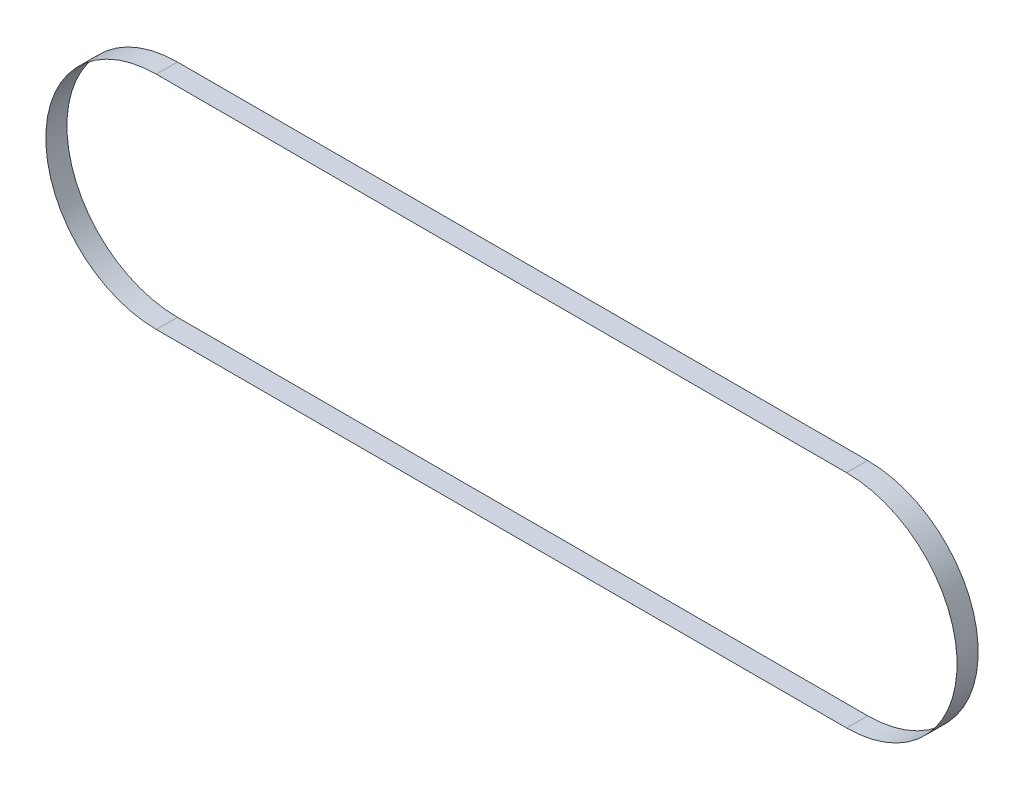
ISO-10303-21;
HEADER;
FILE_DESCRIPTION(('STEP AP214'),'2;1');
FILE_NAME('part.step','',(''),(''),'','','');
FILE_SCHEMA(('AUTOMOTIVE_DESIGN { 1 0 10303 214 1 1 1 1 }'));
ENDSEC;
DATA;
#1=APPLICATION_CONTEXT('core data for automotive mechanical design processes');
#2=APPLICATION_PROTOCOL_DEFINITION('international standard','automotive_design',2000,#1);
#3=PRODUCT_CONTEXT('',#1,'mechanical');
#4=PRODUCT('Part','Part','',(#3));
#5=PRODUCT_RELATED_PRODUCT_CATEGORY('part','',(#4));
#6=PRODUCT_DEFINITION_FORMATION('','',#4);
#7=PRODUCT_DEFINITION_CONTEXT('part definition',#1,'design');
#8=PRODUCT_DEFINITION('design','',#6,#7);
#9=PRODUCT_DEFINITION_SHAPE('','',#8);
#10=(LENGTH_UNIT() NAMED_UNIT(*) SI_UNIT(.MILLI.,.METRE.));
#11=(NAMED_UNIT(*) PLANE_ANGLE_UNIT() SI_UNIT($,.RADIAN.));
#12=(NAMED_UNIT(*) SI_UNIT($,.STERADIAN.) SOLID_ANGLE_UNIT());
#13=UNCERTAINTY_MEASURE_WITH_UNIT(LENGTH_MEASURE(1.E-05),#10,'distance_accuracy_value','');
#14=(GEOMETRIC_REPRESENTATION_CONTEXT(3) GLOBAL_UNCERTAINTY_ASSIGNED_CONTEXT((#13)) GLOBAL_UNIT_ASSIGNED_CONTEXT((#10,
#11,#12)) REPRESENTATION_CONTEXT('',''));
#15=CARTESIAN_POINT('',(0.,0.,0.));
#16=DIRECTION('',(0.,0.,1.));
#17=DIRECTION('',(1.,0.,0.));
#18=AXIS2_PLACEMENT_3D('',#15,#16,#17);
#19=CARTESIAN_POINT('',(253.47,0.,3.875));
#20=DIRECTION('',(0.,0.,-1.));
#21=DIRECTION('',(-1.,0.,0.));
#22=AXIS2_PLACEMENT_3D('',#19,#20,#21);
#23=PLANE('',#22);
#24=CARTESIAN_POINT('',(253.47,0.,3.875));
#25=DIRECTION('',(0.,0.,-1.));
#26=DIRECTION('',(-1.,0.,0.));
#27=AXIS2_PLACEMENT_3D('',#24,#25,#26);
#28=CIRCLE('',#27,40.59505);
#29=CARTESIAN_POINT('',(253.47,-40.59505,3.875));
#30=VERTEX_POINT('',#29);
#31=CARTESIAN_POINT('',(253.47,40.59505,3.875));
#32=VERTEX_POINT('',#31);
#33=EDGE_CURVE('E158',#30,#32,#28,.F.);
#34=ORIENTED_EDGE('',*,*,#33,.T.);
#35=DIRECTION('',(-1.,0.,0.));
#36=VECTOR('',#35,1.);
#37=CARTESIAN_POINT('',(253.47,40.59505,3.875));
#38=LINE('',#37,#36);
#39=CARTESIAN_POINT('',(0.,40.59505,3.875));
#40=VERTEX_POINT('',#39);
#41=EDGE_CURVE('E161',#32,#40,#38,.T.);
#42=ORIENTED_EDGE('',*,*,#41,.T.);
#43=CARTESIAN_POINT('',(0.,0.,3.875));
#44=DIRECTION('',(0.,0.,-1.));
#45=DIRECTION('',(-1.,0.,0.));
#46=AXIS2_PLACEMENT_3D('',#43,#44,#45);
#47=CIRCLE('',#46,40.59505);
#48=CARTESIAN_POINT('',(0.,-40.59505,3.875));
#49=VERTEX_POINT('',#48);
#50=EDGE_CURVE('E164',#40,#49,#47,.F.);
#51=ORIENTED_EDGE('',*,*,#50,.T.);
#52=DIRECTION('',(1.,0.,0.));
#53=VECTOR('',#52,1.);
#54=CARTESIAN_POINT('',(253.47,-40.59505,3.875));
#55=LINE('',#54,#53);
#56=EDGE_CURVE('E166',#49,#30,#55,.T.);
#57=ORIENTED_EDGE('',*,*,#56,.T.);
#58=EDGE_LOOP('',(#34,#42,#51,#57));
#59=FACE_BOUND('',#58,.T.);
#60=CARTESIAN_POINT('',(253.47,0.,3.875));
#61=DIRECTION('',(0.,0.,-1.));
#62=DIRECTION('',(-1.,0.,0.));
#63=AXIS2_PLACEMENT_3D('',#60,#61,#62);
#64=CIRCLE('',#63,40.59495);
#65=CARTESIAN_POINT('',(253.47,-40.59495,3.875));
#66=VERTEX_POINT('',#65);
#67=CARTESIAN_POINT('',(253.47,40.59495,3.875));
#68=VERTEX_POINT('',#67);
#69=EDGE_CURVE('E122',#66,#68,#64,.F.);
#70=ORIENTED_EDGE('',*,*,#69,.F.);
#71=DIRECTION('',(1.,0.,0.));
#72=VECTOR('',#71,1.);
#73=CARTESIAN_POINT('',(253.47,-40.59495,3.875));
#74=LINE('',#73,#72);
#75=CARTESIAN_POINT('',(0.,-40.59495,3.875));
#76=VERTEX_POINT('',#75);
#77=EDGE_CURVE('E144',#76,#66,#74,.T.);
#78=ORIENTED_EDGE('',*,*,#77,.F.);
#79=CARTESIAN_POINT('',(0.,0.,3.875));
#80=DIRECTION('',(0.,0.,-1.));
#81=DIRECTION('',(-1.,0.,0.));
#82=AXIS2_PLACEMENT_3D('',#79,#80,#81);
#83=CIRCLE('',#82,40.59495);
#84=CARTESIAN_POINT('',(0.,40.59495,3.875));
#85=VERTEX_POINT('',#84);
#86=EDGE_CURVE('E142',#85,#76,#83,.F.);
#87=ORIENTED_EDGE('',*,*,#86,.F.);
#88=DIRECTION('',(-1.,0.,0.));
#89=VECTOR('',#88,1.);
#90=CARTESIAN_POINT('',(253.47,40.59495,3.875));
#91=LINE('',#90,#89);
#92=EDGE_CURVE('E130',#68,#85,#91,.T.);
#93=ORIENTED_EDGE('',*,*,#92,.F.);
#94=EDGE_LOOP('',(#70,#78,#87,#93));
#95=FACE_BOUND('',#94,.T.);
#96=ADVANCED_FACE('F57',(#59,#95),#23,.F.);
#97=CARTESIAN_POINT('',(253.47,0.,-3.875));
#98=DIRECTION('',(0.,0.,-1.));
#99=DIRECTION('',(-1.,0.,0.));
#100=AXIS2_PLACEMENT_3D('',#97,#98,#99);
#101=PLANE('',#100);
#102=CARTESIAN_POINT('',(253.47,0.,-3.875));
#103=DIRECTION('',(0.,0.,-1.));
#104=DIRECTION('',(-1.,0.,0.));
#105=AXIS2_PLACEMENT_3D('',#102,#103,#104);
#106=CIRCLE('',#105,40.59505);
#107=CARTESIAN_POINT('',(253.47,-40.59505,-3.875));
#108=VERTEX_POINT('',#107);
#109=CARTESIAN_POINT('',(253.47,40.59505,-3.875));
#110=VERTEX_POINT('',#109);
#111=EDGE_CURVE('E138',#108,#110,#106,.F.);
#112=ORIENTED_EDGE('',*,*,#111,.F.);
#113=DIRECTION('',(1.,0.,0.));
#114=VECTOR('',#113,1.);
#115=CARTESIAN_POINT('',(253.47,-40.59505,-3.875));
#116=LINE('',#115,#114);
#117=CARTESIAN_POINT('',(0.,-40.59505,-3.875));
#118=VERTEX_POINT('',#117);
#119=EDGE_CURVE('E162',#118,#108,#116,.T.);
#120=ORIENTED_EDGE('',*,*,#119,.F.);
#121=CARTESIAN_POINT('',(0.,0.,-3.875));
#122=DIRECTION('',(0.,0.,-1.));
#123=DIRECTION('',(-1.,0.,0.));
#124=AXIS2_PLACEMENT_3D('',#121,#122,#123);
#125=CIRCLE('',#124,40.59505);
#126=CARTESIAN_POINT('',(0.,40.59505,-3.875));
#127=VERTEX_POINT('',#126);
#128=EDGE_CURVE('E173',#127,#118,#125,.F.);
#129=ORIENTED_EDGE('',*,*,#128,.F.);
#130=DIRECTION('',(-1.,0.,0.));
#131=VECTOR('',#130,1.);
#132=CARTESIAN_POINT('',(253.47,40.59505,-3.875));
#133=LINE('',#132,#131);
#134=EDGE_CURVE('E171',#110,#127,#133,.T.);
#135=ORIENTED_EDGE('',*,*,#134,.F.);
#136=EDGE_LOOP('',(#112,#120,#129,#135));
#137=FACE_BOUND('',#136,.T.);
#138=DIRECTION('',(1.,0.,0.));
#139=VECTOR('',#138,1.);
#140=CARTESIAN_POINT('',(253.47,-40.59495,-3.875));
#141=LINE('',#140,#139);
#142=CARTESIAN_POINT('',(0.,-40.59495,-3.875));
#143=VERTEX_POINT('',#142);
#144=CARTESIAN_POINT('',(253.47,-40.59495,-3.875));
#145=VERTEX_POINT('',#144);
#146=EDGE_CURVE('E131',#143,#145,#141,.T.);
#147=ORIENTED_EDGE('',*,*,#146,.T.);
#148=CARTESIAN_POINT('',(253.47,0.,-3.875));
#149=DIRECTION('',(0.,0.,-1.));
#150=DIRECTION('',(-1.,0.,0.));
#151=AXIS2_PLACEMENT_3D('',#148,#149,#150);
#152=CIRCLE('',#151,40.59495);
#153=CARTESIAN_POINT('',(253.47,40.59495,-3.875));
#154=VERTEX_POINT('',#153);
#155=EDGE_CURVE('E80',#145,#154,#152,.F.);
#156=ORIENTED_EDGE('',*,*,#155,.T.);
#157=DIRECTION('',(-1.,0.,0.));
#158=VECTOR('',#157,1.);
#159=CARTESIAN_POINT('',(253.47,40.59495,-3.875));
#160=LINE('',#159,#158);
#161=CARTESIAN_POINT('',(0.,40.59495,-3.875));
#162=VERTEX_POINT('',#161);
#163=EDGE_CURVE('E137',#154,#162,#160,.T.);
#164=ORIENTED_EDGE('',*,*,#163,.T.);
#165=CARTESIAN_POINT('',(0.,0.,-3.875));
#166=DIRECTION('',(0.,0.,-1.));
#167=DIRECTION('',(-1.,0.,0.));
#168=AXIS2_PLACEMENT_3D('',#165,#166,#167);
#169=CIRCLE('',#168,40.59495);
#170=EDGE_CURVE('E150',#162,#143,#169,.F.);
#171=ORIENTED_EDGE('',*,*,#170,.T.);
#172=EDGE_LOOP('',(#147,#156,#164,#171));
#173=FACE_BOUND('',#172,.T.);
#174=ADVANCED_FACE('F191',(#137,#173),#101,.T.);
#175=CARTESIAN_POINT('',(253.47,0.,3.875));
#176=DIRECTION('',(0.,0.,-1.));
#177=DIRECTION('',(-1.,0.,0.));
#178=AXIS2_PLACEMENT_3D('',#175,#176,#177);
#179=CYLINDRICAL_SURFACE('',#178,40.59505);
#180=ORIENTED_EDGE('',*,*,#111,.T.);
#181=DIRECTION('',(0.,0.,-1.));
#182=VECTOR('',#181,1.);
#183=CARTESIAN_POINT('',(253.47,40.59505,3.875));
#184=LINE('',#183,#182);
#185=EDGE_CURVE('E12',#32,#110,#184,.T.);
#186=ORIENTED_EDGE('',*,*,#185,.F.);
#187=ORIENTED_EDGE('',*,*,#33,.F.);
#188=DIRECTION('',(0.,0.,-1.));
#189=VECTOR('',#188,1.);
#190=CARTESIAN_POINT('',(253.47,-40.59505,3.875));
#191=LINE('',#190,#189);
#192=EDGE_CURVE('E168',#30,#108,#191,.T.);
#193=ORIENTED_EDGE('',*,*,#192,.T.);
#194=EDGE_LOOP('',(#180,#186,#187,#193));
#195=FACE_BOUND('',#194,.T.);
#196=ADVANCED_FACE('F59',(#195),#179,.T.);
#197=CARTESIAN_POINT('',(253.47,40.59505,3.875));
#198=DIRECTION('',(0.,-1.,0.));
#199=DIRECTION('',(1.,0.,0.));
#200=AXIS2_PLACEMENT_3D('',#197,#198,#199);
#201=PLANE('',#200);
#202=ORIENTED_EDGE('',*,*,#134,.T.);
#203=DIRECTION('',(0.,0.,-1.));
#204=VECTOR('',#203,1.);
#205=CARTESIAN_POINT('',(0.,40.59505,3.875));
#206=LINE('',#205,#204);
#207=EDGE_CURVE('E65',#40,#127,#206,.T.);
#208=ORIENTED_EDGE('',*,*,#207,.F.);
#209=ORIENTED_EDGE('',*,*,#41,.F.);
#210=ORIENTED_EDGE('',*,*,#185,.T.);
#211=EDGE_LOOP('',(#202,#208,#209,#210));
#212=FACE_BOUND('',#211,.T.);
#213=ADVANCED_FACE('F201',(#212),#201,.F.);
#214=CARTESIAN_POINT('',(0.,0.,3.875));
#215=DIRECTION('',(0.,0.,-1.));
#216=DIRECTION('',(-1.,0.,0.));
#217=AXIS2_PLACEMENT_3D('',#214,#215,#216);
#218=CYLINDRICAL_SURFACE('',#217,40.59505);
#219=ORIENTED_EDGE('',*,*,#128,.T.);
#220=DIRECTION('',(0.,0.,-1.));
#221=VECTOR('',#220,1.);
#222=CARTESIAN_POINT('',(0.,-40.59505,3.875));
#223=LINE('',#222,#221);
#224=EDGE_CURVE('E178',#49,#118,#223,.T.);
#225=ORIENTED_EDGE('',*,*,#224,.F.);
#226=ORIENTED_EDGE('',*,*,#50,.F.);
#227=ORIENTED_EDGE('',*,*,#207,.T.);
#228=EDGE_LOOP('',(#219,#225,#226,#227));
#229=FACE_BOUND('',#228,.T.);
#230=ADVANCED_FACE('F185',(#229),#218,.T.);
#231=CARTESIAN_POINT('',(253.47,-40.59505,3.875));
#232=DIRECTION('',(0.,1.,0.));
#233=DIRECTION('',(-1.,0.,0.));
#234=AXIS2_PLACEMENT_3D('',#231,#232,#233);
#235=PLANE('',#234);
#236=ORIENTED_EDGE('',*,*,#119,.T.);
#237=ORIENTED_EDGE('',*,*,#192,.F.);
#238=ORIENTED_EDGE('',*,*,#56,.F.);
#239=ORIENTED_EDGE('',*,*,#224,.T.);
#240=EDGE_LOOP('',(#236,#237,#238,#239));
#241=FACE_BOUND('',#240,.T.);
#242=ADVANCED_FACE('F195',(#241),#235,.F.);
#243=CARTESIAN_POINT('',(253.47,0.,3.875));
#244=DIRECTION('',(0.,0.,-1.));
#245=DIRECTION('',(-1.,0.,0.));
#246=AXIS2_PLACEMENT_3D('',#243,#244,#245);
#247=CYLINDRICAL_SURFACE('',#246,40.59495);
#248=ORIENTED_EDGE('',*,*,#155,.F.);
#249=DIRECTION('',(0.,0.,-1.));
#250=VECTOR('',#249,1.);
#251=CARTESIAN_POINT('',(253.47,-40.59495,3.875));
#252=LINE('',#251,#250);
#253=EDGE_CURVE('E126',#66,#145,#252,.T.);
#254=ORIENTED_EDGE('',*,*,#253,.F.);
#255=ORIENTED_EDGE('',*,*,#69,.T.);
#256=DIRECTION('',(0.,0.,-1.));
#257=VECTOR('',#256,1.);
#258=CARTESIAN_POINT('',(253.47,40.59495,3.875));
#259=LINE('',#258,#257);
#260=EDGE_CURVE('E125',#68,#154,#259,.T.);
#261=ORIENTED_EDGE('',*,*,#260,.T.);
#262=EDGE_LOOP('',(#248,#254,#255,#261));
#263=FACE_BOUND('',#262,.T.);
#264=ADVANCED_FACE('F124',(#263),#247,.F.);
#265=CARTESIAN_POINT('',(253.47,40.59495,3.875));
#266=DIRECTION('',(0.,-1.,0.));
#267=DIRECTION('',(1.,0.,0.));
#268=AXIS2_PLACEMENT_3D('',#265,#266,#267);
#269=PLANE('',#268);
#270=ORIENTED_EDGE('',*,*,#163,.F.);
#271=ORIENTED_EDGE('',*,*,#260,.F.);
#272=ORIENTED_EDGE('',*,*,#92,.T.);
#273=DIRECTION('',(0.,0.,-1.));
#274=VECTOR('',#273,1.);
#275=CARTESIAN_POINT('',(0.,40.59495,3.875));
#276=LINE('',#275,#274);
#277=EDGE_CURVE('E139',#85,#162,#276,.T.);
#278=ORIENTED_EDGE('',*,*,#277,.T.);
#279=EDGE_LOOP('',(#270,#271,#272,#278));
#280=FACE_BOUND('',#279,.T.);
#281=ADVANCED_FACE('F134',(#280),#269,.T.);
#282=CARTESIAN_POINT('',(0.,0.,3.875));
#283=DIRECTION('',(0.,0.,-1.));
#284=DIRECTION('',(-1.,0.,0.));
#285=AXIS2_PLACEMENT_3D('',#282,#283,#284);
#286=CYLINDRICAL_SURFACE('',#285,40.59495);
#287=ORIENTED_EDGE('',*,*,#170,.F.);
#288=ORIENTED_EDGE('',*,*,#277,.F.);
#289=ORIENTED_EDGE('',*,*,#86,.T.);
#290=DIRECTION('',(0.,0.,-1.));
#291=VECTOR('',#290,1.);
#292=CARTESIAN_POINT('',(0.,-40.59495,3.875));
#293=LINE('',#292,#291);
#294=EDGE_CURVE('E72',#76,#143,#293,.T.);
#295=ORIENTED_EDGE('',*,*,#294,.T.);
#296=EDGE_LOOP('',(#287,#288,#289,#295));
#297=FACE_BOUND('',#296,.T.);
#298=ADVANCED_FACE('F224',(#297),#286,.F.);
#299=CARTESIAN_POINT('',(253.47,-40.59495,3.875));
#300=DIRECTION('',(0.,1.,0.));
#301=DIRECTION('',(-1.,0.,0.));
#302=AXIS2_PLACEMENT_3D('',#299,#300,#301);
#303=PLANE('',#302);
#304=ORIENTED_EDGE('',*,*,#146,.F.);
#305=ORIENTED_EDGE('',*,*,#294,.F.);
#306=ORIENTED_EDGE('',*,*,#77,.T.);
#307=ORIENTED_EDGE('',*,*,#253,.T.);
#308=EDGE_LOOP('',(#304,#305,#306,#307));
#309=FACE_BOUND('',#308,.T.);
#310=ADVANCED_FACE('F228',(#309),#303,.T.);
#311=CLOSED_SHELL('',(#96,#174,#196,#213,#230,#242,#264,#281,#298,#310));
#312=MANIFOLD_SOLID_BREP('B2',#311);
#313=ADVANCED_BREP_SHAPE_REPRESENTATION('',(#18,#312),#14);
#314=SHAPE_DEFINITION_REPRESENTATION(#9,#313);
ENDSEC;
END-ISO-10303-21;
